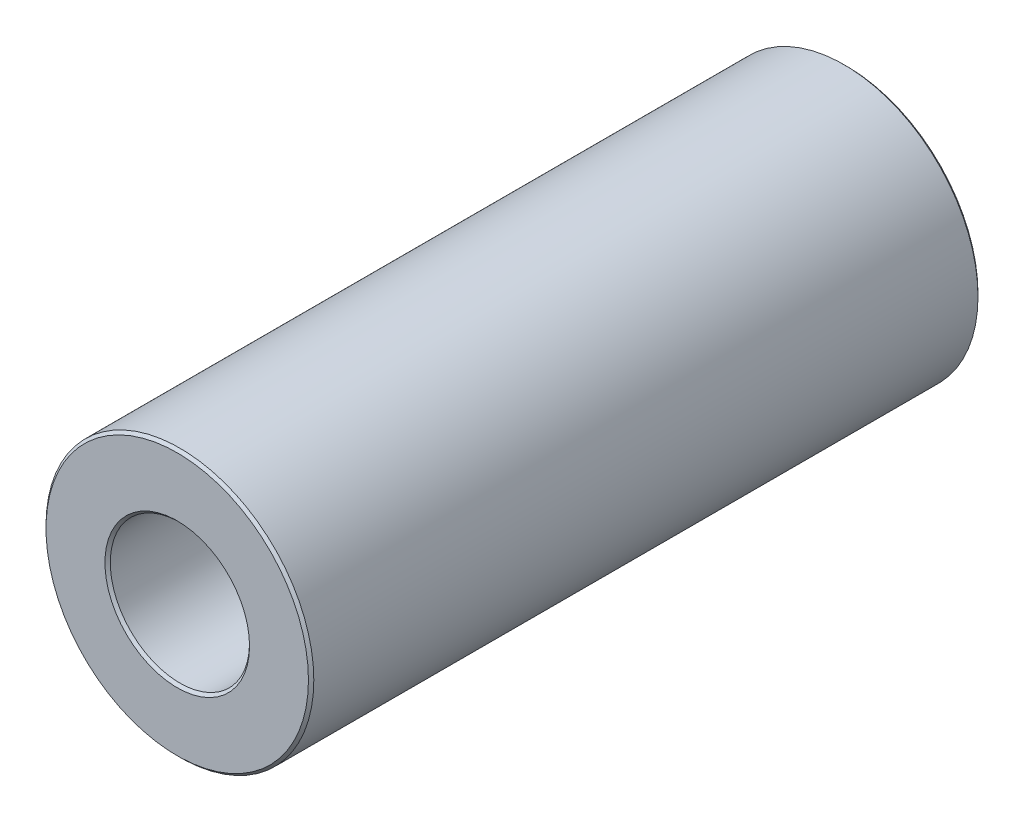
ISO-10303-21;
HEADER;
FILE_DESCRIPTION(('STEP AP214'),'2;1');
FILE_NAME('part.step','',(''),(''),'','','');
FILE_SCHEMA(('AUTOMOTIVE_DESIGN { 1 0 10303 214 1 1 1 1 }'));
ENDSEC;
DATA;
#1=APPLICATION_CONTEXT('core data for automotive mechanical design processes');
#2=APPLICATION_PROTOCOL_DEFINITION('international standard','automotive_design',2000,#1);
#3=PRODUCT_CONTEXT('',#1,'mechanical');
#4=PRODUCT('Part','Part','',(#3));
#5=PRODUCT_RELATED_PRODUCT_CATEGORY('part','',(#4));
#6=PRODUCT_DEFINITION_FORMATION('','',#4);
#7=PRODUCT_DEFINITION_CONTEXT('part definition',#1,'design');
#8=PRODUCT_DEFINITION('design','',#6,#7);
#9=PRODUCT_DEFINITION_SHAPE('','',#8);
#10=(LENGTH_UNIT() NAMED_UNIT(*) SI_UNIT(.MILLI.,.METRE.));
#11=(NAMED_UNIT(*) PLANE_ANGLE_UNIT() SI_UNIT($,.RADIAN.));
#12=(NAMED_UNIT(*) SI_UNIT($,.STERADIAN.) SOLID_ANGLE_UNIT());
#13=UNCERTAINTY_MEASURE_WITH_UNIT(LENGTH_MEASURE(1.E-05),#10,'distance_accuracy_value','');
#14=(GEOMETRIC_REPRESENTATION_CONTEXT(3) GLOBAL_UNCERTAINTY_ASSIGNED_CONTEXT((#13)) GLOBAL_UNIT_ASSIGNED_CONTEXT((#10,
#11,#12)) REPRESENTATION_CONTEXT('',''));
#15=CARTESIAN_POINT('',(0.,0.,0.));
#16=DIRECTION('',(0.,0.,1.));
#17=DIRECTION('',(1.,0.,0.));
#18=AXIS2_PLACEMENT_3D('',#15,#16,#17);
#19=CARTESIAN_POINT('',(0.,0.,12.5));
#20=DIRECTION('',(0.,0.,1.));
#21=DIRECTION('',(1.,0.,0.));
#22=AXIS2_PLACEMENT_3D('',#19,#20,#21);
#23=PLANE('',#22);
#24=CARTESIAN_POINT('',(0.,0.,12.5));
#25=DIRECTION('',(0.,0.,1.));
#26=DIRECTION('',(1.,0.,0.));
#27=AXIS2_PLACEMENT_3D('',#24,#25,#26);
#28=CIRCLE('',#27,2.7);
#29=CARTESIAN_POINT('',(2.7,0.,12.5));
#30=VERTEX_POINT('',#29);
#31=EDGE_CURVE('E10',#30,#30,#28,.F.);
#32=ORIENTED_EDGE('',*,*,#31,.T.);
#33=EDGE_LOOP('',(#32));
#34=FACE_BOUND('',#33,.T.);
#35=CARTESIAN_POINT('',(0.,0.,12.5));
#36=DIRECTION('',(0.,0.,1.));
#37=DIRECTION('',(1.,0.,0.));
#38=AXIS2_PLACEMENT_3D('',#35,#36,#37);
#39=CIRCLE('',#38,4.9);
#40=CARTESIAN_POINT('',(4.9,0.,12.5));
#41=VERTEX_POINT('',#40);
#42=EDGE_CURVE('E45',#41,#41,#39,.T.);
#43=ORIENTED_EDGE('',*,*,#42,.T.);
#44=EDGE_LOOP('',(#43));
#45=FACE_BOUND('',#44,.T.);
#46=ADVANCED_FACE('F37',(#34,#45),#23,.T.);
#47=CARTESIAN_POINT('',(0.,0.,-12.5));
#48=DIRECTION('',(0.,0.,1.));
#49=DIRECTION('',(1.,0.,0.));
#50=AXIS2_PLACEMENT_3D('',#47,#48,#49);
#51=PLANE('',#50);
#52=CARTESIAN_POINT('',(0.,0.,-12.5));
#53=DIRECTION('',(0.,0.,1.));
#54=DIRECTION('',(1.,0.,0.));
#55=AXIS2_PLACEMENT_3D('',#52,#53,#54);
#56=CIRCLE('',#55,4.9);
#57=CARTESIAN_POINT('',(4.9,0.,-12.5));
#58=VERTEX_POINT('',#57);
#59=EDGE_CURVE('E63',#58,#58,#56,.F.);
#60=ORIENTED_EDGE('',*,*,#59,.T.);
#61=EDGE_LOOP('',(#60));
#62=FACE_BOUND('',#61,.T.);
#63=CARTESIAN_POINT('',(0.,0.,-12.5));
#64=DIRECTION('',(0.,0.,1.));
#65=DIRECTION('',(1.,0.,0.));
#66=AXIS2_PLACEMENT_3D('',#63,#64,#65);
#67=CIRCLE('',#66,2.7);
#68=CARTESIAN_POINT('',(2.7,0.,-12.5));
#69=VERTEX_POINT('',#68);
#70=EDGE_CURVE('E67',#69,#69,#67,.T.);
#71=ORIENTED_EDGE('',*,*,#70,.T.);
#72=EDGE_LOOP('',(#71));
#73=FACE_BOUND('',#72,.T.);
#74=ADVANCED_FACE('F89',(#62,#73),#51,.F.);
#75=CARTESIAN_POINT('',(0.,0.,12.5));
#76=DIRECTION('',(0.,0.,-1.));
#77=DIRECTION('',(-1.,0.,0.));
#78=AXIS2_PLACEMENT_3D('',#75,#76,#77);
#79=CYLINDRICAL_SURFACE('',#78,5.);
#80=CARTESIAN_POINT('',(0.,0.,-12.4));
#81=DIRECTION('',(0.,0.,1.));
#82=DIRECTION('',(1.,0.,0.));
#83=AXIS2_PLACEMENT_3D('',#80,#81,#82);
#84=CIRCLE('',#83,5.);
#85=CARTESIAN_POINT('',(5.,0.,-12.4));
#86=VERTEX_POINT('',#85);
#87=EDGE_CURVE('E70',#86,#86,#84,.T.);
#88=ORIENTED_EDGE('',*,*,#87,.T.);
#89=EDGE_LOOP('',(#88));
#90=FACE_BOUND('',#89,.T.);
#91=CARTESIAN_POINT('',(0.,0.,12.4));
#92=DIRECTION('',(0.,0.,1.));
#93=DIRECTION('',(1.,0.,0.));
#94=AXIS2_PLACEMENT_3D('',#91,#92,#93);
#95=CIRCLE('',#94,5.);
#96=CARTESIAN_POINT('',(5.,0.,12.4));
#97=VERTEX_POINT('',#96);
#98=EDGE_CURVE('E74',#97,#97,#95,.F.);
#99=ORIENTED_EDGE('',*,*,#98,.T.);
#100=EDGE_LOOP('',(#99));
#101=FACE_BOUND('',#100,.T.);
#102=ADVANCED_FACE('F78',(#90,#101),#79,.T.);
#103=CARTESIAN_POINT('',(0.,0.,12.5));
#104=DIRECTION('',(0.,0.,-1.));
#105=DIRECTION('',(-1.,0.,0.));
#106=AXIS2_PLACEMENT_3D('',#103,#104,#105);
#107=CYLINDRICAL_SURFACE('',#106,2.6);
#108=CARTESIAN_POINT('',(0.,0.,-12.4));
#109=DIRECTION('',(0.,0.,1.));
#110=DIRECTION('',(1.,0.,0.));
#111=AXIS2_PLACEMENT_3D('',#108,#109,#110);
#112=CIRCLE('',#111,2.6);
#113=CARTESIAN_POINT('',(2.6,0.,-12.4));
#114=VERTEX_POINT('',#113);
#115=EDGE_CURVE('E52',#114,#114,#112,.F.);
#116=ORIENTED_EDGE('',*,*,#115,.T.);
#117=EDGE_LOOP('',(#116));
#118=FACE_BOUND('',#117,.T.);
#119=CARTESIAN_POINT('',(0.,0.,12.4));
#120=DIRECTION('',(0.,0.,1.));
#121=DIRECTION('',(1.,0.,0.));
#122=AXIS2_PLACEMENT_3D('',#119,#120,#121);
#123=CIRCLE('',#122,2.6);
#124=CARTESIAN_POINT('',(2.6,0.,12.4));
#125=VERTEX_POINT('',#124);
#126=EDGE_CURVE('E57',#125,#125,#123,.T.);
#127=ORIENTED_EDGE('',*,*,#126,.T.);
#128=EDGE_LOOP('',(#127));
#129=FACE_BOUND('',#128,.T.);
#130=ADVANCED_FACE('F97',(#118,#129),#107,.F.);
#131=CARTESIAN_POINT('',(0.,0.,-12.4));
#132=DIRECTION('',(0.,0.,1.));
#133=DIRECTION('',(1.,0.,0.));
#134=AXIS2_PLACEMENT_3D('',#131,#132,#133);
#135=CONICAL_SURFACE('',#134,5.,0.785398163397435);
#136=ORIENTED_EDGE('',*,*,#59,.F.);
#137=EDGE_LOOP('',(#136));
#138=FACE_BOUND('',#137,.T.);
#139=ORIENTED_EDGE('',*,*,#87,.F.);
#140=EDGE_LOOP('',(#139));
#141=FACE_BOUND('',#140,.T.);
#142=ADVANCED_FACE('F102',(#138,#141),#135,.T.);
#143=CARTESIAN_POINT('',(0.,0.,-12.5));
#144=DIRECTION('',(0.,0.,-1.));
#145=DIRECTION('',(-1.,0.,0.));
#146=AXIS2_PLACEMENT_3D('',#143,#144,#145);
#147=CONICAL_SURFACE('',#146,2.7,0.785398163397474);
#148=ORIENTED_EDGE('',*,*,#115,.F.);
#149=EDGE_LOOP('',(#148));
#150=FACE_BOUND('',#149,.T.);
#151=ORIENTED_EDGE('',*,*,#70,.F.);
#152=EDGE_LOOP('',(#151));
#153=FACE_BOUND('',#152,.T.);
#154=ADVANCED_FACE('F86',(#150,#153),#147,.F.);
#155=CARTESIAN_POINT('',(0.,0.,12.4));
#156=DIRECTION('',(0.,0.,1.));
#157=DIRECTION('',(1.,0.,0.));
#158=AXIS2_PLACEMENT_3D('',#155,#156,#157);
#159=CONICAL_SURFACE('',#158,2.6,0.78539816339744);
#160=ORIENTED_EDGE('',*,*,#31,.F.);
#161=EDGE_LOOP('',(#160));
#162=FACE_BOUND('',#161,.T.);
#163=ORIENTED_EDGE('',*,*,#126,.F.);
#164=EDGE_LOOP('',(#163));
#165=FACE_BOUND('',#164,.T.);
#166=ADVANCED_FACE('F82',(#162,#165),#159,.F.);
#167=CARTESIAN_POINT('',(0.,0.,12.5));
#168=DIRECTION('',(0.,0.,-1.));
#169=DIRECTION('',(-1.,0.,0.));
#170=AXIS2_PLACEMENT_3D('',#167,#168,#169);
#171=CONICAL_SURFACE('',#170,4.9,0.785398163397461);
#172=ORIENTED_EDGE('',*,*,#98,.F.);
#173=EDGE_LOOP('',(#172));
#174=FACE_BOUND('',#173,.T.);
#175=ORIENTED_EDGE('',*,*,#42,.F.);
#176=EDGE_LOOP('',(#175));
#177=FACE_BOUND('',#176,.T.);
#178=ADVANCED_FACE('F39',(#174,#177),#171,.T.);
#179=CLOSED_SHELL('',(#46,#74,#102,#130,#142,#154,#166,#178));
#180=MANIFOLD_SOLID_BREP('B2',#179);
#181=ADVANCED_BREP_SHAPE_REPRESENTATION('',(#18,#180),#14);
#182=SHAPE_DEFINITION_REPRESENTATION(#9,#181);
ENDSEC;
END-ISO-10303-21;
